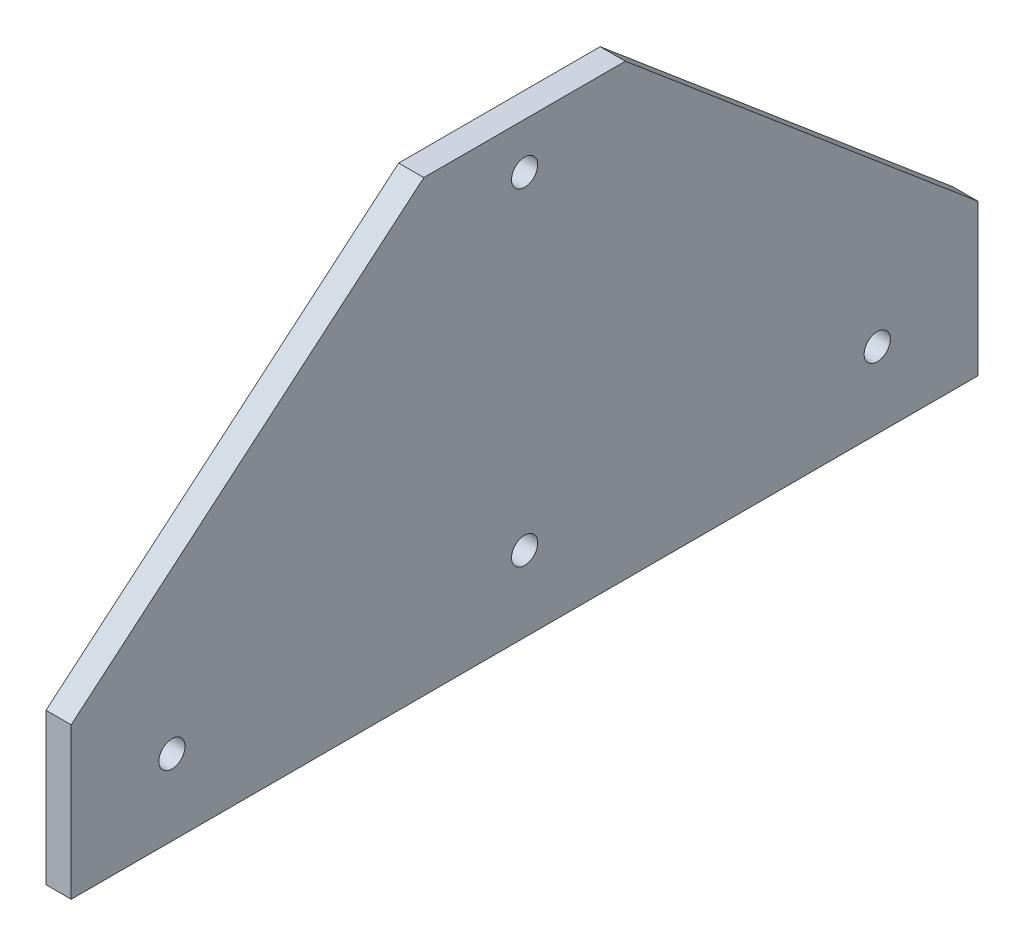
ISO-10303-21;
HEADER;
FILE_DESCRIPTION(('STEP AP214'),'2;1');
FILE_NAME('part.step','',(''),(''),'','','');
FILE_SCHEMA(('AUTOMOTIVE_DESIGN { 1 0 10303 214 1 1 1 1 }'));
ENDSEC;
DATA;
#1=APPLICATION_CONTEXT('core data for automotive mechanical design processes');
#2=APPLICATION_PROTOCOL_DEFINITION('international standard','automotive_design',2000,#1);
#3=PRODUCT_CONTEXT('',#1,'mechanical');
#4=PRODUCT('Part','Part','',(#3));
#5=PRODUCT_RELATED_PRODUCT_CATEGORY('part','',(#4));
#6=PRODUCT_DEFINITION_FORMATION('','',#4);
#7=PRODUCT_DEFINITION_CONTEXT('part definition',#1,'design');
#8=PRODUCT_DEFINITION('design','',#6,#7);
#9=PRODUCT_DEFINITION_SHAPE('','',#8);
#10=(LENGTH_UNIT() NAMED_UNIT(*) SI_UNIT(.MILLI.,.METRE.));
#11=(NAMED_UNIT(*) PLANE_ANGLE_UNIT() SI_UNIT($,.RADIAN.));
#12=(NAMED_UNIT(*) SI_UNIT($,.STERADIAN.) SOLID_ANGLE_UNIT());
#13=UNCERTAINTY_MEASURE_WITH_UNIT(LENGTH_MEASURE(1.E-05),#10,'distance_accuracy_value','');
#14=(GEOMETRIC_REPRESENTATION_CONTEXT(3) GLOBAL_UNCERTAINTY_ASSIGNED_CONTEXT((#13)) GLOBAL_UNIT_ASSIGNED_CONTEXT((#10,
#11,#12)) REPRESENTATION_CONTEXT('',''));
#15=CARTESIAN_POINT('',(0.,0.,0.));
#16=DIRECTION('',(0.,0.,1.));
#17=DIRECTION('',(1.,0.,0.));
#18=AXIS2_PLACEMENT_3D('',#15,#16,#17);
#19=CARTESIAN_POINT('',(6.35,34.8644879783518,77.6345072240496));
#20=DIRECTION('',(0.,0.,-1.));
#21=DIRECTION('',(-1.,0.,0.));
#22=AXIS2_PLACEMENT_3D('',#19,#20,#21);
#23=PLANE('',#22);
#24=DIRECTION('',(0.,-1.,0.));
#25=VECTOR('',#24,1.);
#26=CARTESIAN_POINT('',(0.,34.8644879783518,77.6345072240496));
#27=LINE('',#26,#25);
#28=CARTESIAN_POINT('',(0.,72.9644879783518,77.6345072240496));
#29=VERTEX_POINT('',#28);
#30=CARTESIAN_POINT('',(0.,34.8644879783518,77.6345072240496));
#31=VERTEX_POINT('',#30);
#32=EDGE_CURVE('E117',#29,#31,#27,.T.);
#33=ORIENTED_EDGE('',*,*,#32,.T.);
#34=DIRECTION('',(-1.,0.,0.));
#35=VECTOR('',#34,1.);
#36=CARTESIAN_POINT('',(6.35,34.8644879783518,77.6345072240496));
#37=LINE('',#36,#35);
#38=CARTESIAN_POINT('',(6.35,34.8644879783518,77.6345072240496));
#39=VERTEX_POINT('',#38);
#40=EDGE_CURVE('E11',#39,#31,#37,.T.);
#41=ORIENTED_EDGE('',*,*,#40,.F.);
#42=DIRECTION('',(0.,-1.,0.));
#43=VECTOR('',#42,1.);
#44=CARTESIAN_POINT('',(6.35,34.8644879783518,77.6345072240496));
#45=LINE('',#44,#43);
#46=CARTESIAN_POINT('',(6.35,72.9644879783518,77.6345072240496));
#47=VERTEX_POINT('',#46);
#48=EDGE_CURVE('E128',#47,#39,#45,.T.);
#49=ORIENTED_EDGE('',*,*,#48,.F.);
#50=DIRECTION('',(-1.,0.,0.));
#51=VECTOR('',#50,1.);
#52=CARTESIAN_POINT('',(6.35,72.9644879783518,77.6345072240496));
#53=LINE('',#52,#51);
#54=EDGE_CURVE('E113',#47,#29,#53,.T.);
#55=ORIENTED_EDGE('',*,*,#54,.T.);
#56=EDGE_LOOP('',(#33,#41,#49,#55));
#57=FACE_BOUND('',#56,.T.);
#58=ADVANCED_FACE('F33',(#57),#23,.F.);
#59=CARTESIAN_POINT('',(6.35,34.8644879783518,77.6345072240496));
#60=DIRECTION('',(0.,1.,0.));
#61=DIRECTION('',(0.,0.,1.));
#62=AXIS2_PLACEMENT_3D('',#59,#60,#61);
#63=PLANE('',#62);
#64=DIRECTION('',(0.,0.,-1.));
#65=VECTOR('',#64,1.);
#66=CARTESIAN_POINT('',(0.,34.8644879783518,77.6345072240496));
#67=LINE('',#66,#65);
#68=CARTESIAN_POINT('',(0.,34.8644879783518,-150.96549277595));
#69=VERTEX_POINT('',#68);
#70=EDGE_CURVE('E120',#31,#69,#67,.T.);
#71=ORIENTED_EDGE('',*,*,#70,.T.);
#72=DIRECTION('',(-1.,0.,0.));
#73=VECTOR('',#72,1.);
#74=CARTESIAN_POINT('',(6.35,34.8644879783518,-150.96549277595));
#75=LINE('',#74,#73);
#76=CARTESIAN_POINT('',(6.35,34.8644879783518,-150.96549277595));
#77=VERTEX_POINT('',#76);
#78=EDGE_CURVE('E41',#77,#69,#75,.T.);
#79=ORIENTED_EDGE('',*,*,#78,.F.);
#80=DIRECTION('',(0.,0.,-1.));
#81=VECTOR('',#80,1.);
#82=CARTESIAN_POINT('',(6.35,34.8644879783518,77.6345072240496));
#83=LINE('',#82,#81);
#84=EDGE_CURVE('E86',#39,#77,#83,.T.);
#85=ORIENTED_EDGE('',*,*,#84,.F.);
#86=ORIENTED_EDGE('',*,*,#40,.T.);
#87=EDGE_LOOP('',(#71,#79,#85,#86));
#88=FACE_BOUND('',#87,.T.);
#89=ADVANCED_FACE('F153',(#88),#63,.F.);
#90=CARTESIAN_POINT('',(6.35,34.8644879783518,-150.96549277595));
#91=DIRECTION('',(0.,0.,1.));
#92=DIRECTION('',(0.,-1.,0.));
#93=AXIS2_PLACEMENT_3D('',#90,#91,#92);
#94=PLANE('',#93);
#95=DIRECTION('',(0.,1.,0.));
#96=VECTOR('',#95,1.);
#97=CARTESIAN_POINT('',(0.,34.8644879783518,-150.96549277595));
#98=LINE('',#97,#96);
#99=CARTESIAN_POINT('',(0.,72.9644879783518,-150.96549277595));
#100=VERTEX_POINT('',#99);
#101=EDGE_CURVE('E123',#69,#100,#98,.T.);
#102=ORIENTED_EDGE('',*,*,#101,.T.);
#103=DIRECTION('',(-1.,0.,0.));
#104=VECTOR('',#103,1.);
#105=CARTESIAN_POINT('',(6.35,72.9644879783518,-150.96549277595));
#106=LINE('',#105,#104);
#107=CARTESIAN_POINT('',(6.35,72.9644879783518,-150.96549277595));
#108=VERTEX_POINT('',#107);
#109=EDGE_CURVE('E108',#108,#100,#106,.T.);
#110=ORIENTED_EDGE('',*,*,#109,.F.);
#111=DIRECTION('',(0.,1.,0.));
#112=VECTOR('',#111,1.);
#113=CARTESIAN_POINT('',(6.35,34.8644879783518,-150.96549277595));
#114=LINE('',#113,#112);
#115=EDGE_CURVE('E99',#77,#108,#114,.T.);
#116=ORIENTED_EDGE('',*,*,#115,.F.);
#117=ORIENTED_EDGE('',*,*,#78,.T.);
#118=EDGE_LOOP('',(#102,#110,#116,#117));
#119=FACE_BOUND('',#118,.T.);
#120=ADVANCED_FACE('F134',(#119),#94,.F.);
#121=CARTESIAN_POINT('',(6.35,147.98324545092,-62.0654927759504));
#122=DIRECTION('',(0.,-0.76425172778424,0.644918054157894));
#123=DIRECTION('',(0.,-0.644918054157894,-0.76425172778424));
#124=AXIS2_PLACEMENT_3D('',#121,#122,#123);
#125=PLANE('',#124);
#126=DIRECTION('',(0.,0.644918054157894,0.76425172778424));
#127=VECTOR('',#126,1.);
#128=CARTESIAN_POINT('',(0.,147.98324545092,-62.0654927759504));
#129=LINE('',#128,#127);
#130=CARTESIAN_POINT('',(0.,147.98324545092,-62.0654927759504));
#131=VERTEX_POINT('',#130);
#132=EDGE_CURVE('E107',#100,#131,#129,.T.);
#133=ORIENTED_EDGE('',*,*,#132,.T.);
#134=DIRECTION('',(-1.,0.,0.));
#135=VECTOR('',#134,1.);
#136=CARTESIAN_POINT('',(6.35,147.98324545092,-62.0654927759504));
#137=LINE('',#136,#135);
#138=CARTESIAN_POINT('',(6.35,147.98324545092,-62.0654927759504));
#139=VERTEX_POINT('',#138);
#140=EDGE_CURVE('E104',#139,#131,#137,.T.);
#141=ORIENTED_EDGE('',*,*,#140,.F.);
#142=DIRECTION('',(0.,0.644918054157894,0.76425172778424));
#143=VECTOR('',#142,1.);
#144=CARTESIAN_POINT('',(6.35,147.98324545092,-62.0654927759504));
#145=LINE('',#144,#143);
#146=EDGE_CURVE('E93',#108,#139,#145,.T.);
#147=ORIENTED_EDGE('',*,*,#146,.F.);
#148=ORIENTED_EDGE('',*,*,#109,.T.);
#149=EDGE_LOOP('',(#133,#141,#147,#148));
#150=FACE_BOUND('',#149,.T.);
#151=ADVANCED_FACE('F105',(#150),#125,.F.);
#152=CARTESIAN_POINT('',(6.35,147.98324545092,-11.2654927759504));
#153=DIRECTION('',(0.,-1.,0.));
#154=DIRECTION('',(0.,0.,-1.));
#155=AXIS2_PLACEMENT_3D('',#152,#153,#154);
#156=PLANE('',#155);
#157=DIRECTION('',(0.,0.,1.));
#158=VECTOR('',#157,1.);
#159=CARTESIAN_POINT('',(0.,147.98324545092,-11.2654927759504));
#160=LINE('',#159,#158);
#161=CARTESIAN_POINT('',(0.,147.98324545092,-11.2654927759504));
#162=VERTEX_POINT('',#161);
#163=EDGE_CURVE('E72',#131,#162,#160,.T.);
#164=ORIENTED_EDGE('',*,*,#163,.T.);
#165=DIRECTION('',(-1.,0.,0.));
#166=VECTOR('',#165,1.);
#167=CARTESIAN_POINT('',(6.35,147.98324545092,-11.2654927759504));
#168=LINE('',#167,#166);
#169=CARTESIAN_POINT('',(6.35,147.98324545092,-11.2654927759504));
#170=VERTEX_POINT('',#169);
#171=EDGE_CURVE('E109',#170,#162,#168,.T.);
#172=ORIENTED_EDGE('',*,*,#171,.F.);
#173=DIRECTION('',(0.,0.,1.));
#174=VECTOR('',#173,1.);
#175=CARTESIAN_POINT('',(6.35,147.98324545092,-11.2654927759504));
#176=LINE('',#175,#174);
#177=EDGE_CURVE('E97',#139,#170,#176,.T.);
#178=ORIENTED_EDGE('',*,*,#177,.F.);
#179=ORIENTED_EDGE('',*,*,#140,.T.);
#180=EDGE_LOOP('',(#164,#172,#178,#179));
#181=FACE_BOUND('',#180,.T.);
#182=ADVANCED_FACE('F111',(#181),#156,.F.);
#183=CARTESIAN_POINT('',(6.35,72.9644879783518,77.6345072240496));
#184=DIRECTION('',(0.,-0.76425172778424,-0.644918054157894));
#185=DIRECTION('',(0.,0.644918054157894,-0.76425172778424));
#186=AXIS2_PLACEMENT_3D('',#183,#184,#185);
#187=PLANE('',#186);
#188=DIRECTION('',(0.,-0.644918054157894,0.76425172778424));
#189=VECTOR('',#188,1.);
#190=CARTESIAN_POINT('',(0.,72.9644879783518,77.6345072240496));
#191=LINE('',#190,#189);
#192=EDGE_CURVE('E78',#162,#29,#191,.T.);
#193=ORIENTED_EDGE('',*,*,#192,.T.);
#194=ORIENTED_EDGE('',*,*,#54,.F.);
#195=DIRECTION('',(0.,-0.644918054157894,0.76425172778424));
#196=VECTOR('',#195,1.);
#197=CARTESIAN_POINT('',(6.35,72.9644879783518,77.6345072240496));
#198=LINE('',#197,#196);
#199=EDGE_CURVE('E49',#170,#47,#198,.T.);
#200=ORIENTED_EDGE('',*,*,#199,.F.);
#201=ORIENTED_EDGE('',*,*,#171,.T.);
#202=EDGE_LOOP('',(#193,#194,#200,#201));
#203=FACE_BOUND('',#202,.T.);
#204=ADVANCED_FACE('F141',(#203),#187,.F.);
#205=CARTESIAN_POINT('',(6.35,0.,0.));
#206=DIRECTION('',(-1.,0.,0.));
#207=DIRECTION('',(0.,0.,1.));
#208=AXIS2_PLACEMENT_3D('',#205,#206,#207);
#209=PLANE('',#208);
#210=CARTESIAN_POINT('',(6.35,53.9144879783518,-125.56549277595));
#211=DIRECTION('',(-1.,0.,0.));
#212=DIRECTION('',(0.,0.,1.));
#213=AXIS2_PLACEMENT_3D('',#210,#211,#212);
#214=CIRCLE('',#213,3.302);
#215=CARTESIAN_POINT('',(6.35,53.9144879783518,-122.26349277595));
#216=VERTEX_POINT('',#215);
#217=EDGE_CURVE('E236',#216,#216,#214,.T.);
#218=ORIENTED_EDGE('',*,*,#217,.T.);
#219=EDGE_LOOP('',(#218));
#220=FACE_BOUND('',#219,.T.);
#221=CARTESIAN_POINT('',(6.35,136.464487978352,-36.6654927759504));
#222=DIRECTION('',(-1.,0.,0.));
#223=DIRECTION('',(0.,0.,1.));
#224=AXIS2_PLACEMENT_3D('',#221,#222,#223);
#225=CIRCLE('',#224,3.302);
#226=CARTESIAN_POINT('',(6.35,136.464487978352,-33.3634927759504));
#227=VERTEX_POINT('',#226);
#228=EDGE_CURVE('E244',#227,#227,#225,.T.);
#229=ORIENTED_EDGE('',*,*,#228,.T.);
#230=EDGE_LOOP('',(#229));
#231=FACE_BOUND('',#230,.T.);
#232=CARTESIAN_POINT('',(6.35,53.9144879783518,-36.6654927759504));
#233=DIRECTION('',(-1.,0.,0.));
#234=DIRECTION('',(0.,0.,1.));
#235=AXIS2_PLACEMENT_3D('',#232,#233,#234);
#236=CIRCLE('',#235,3.302);
#237=CARTESIAN_POINT('',(6.35,53.9144879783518,-33.3634927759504));
#238=VERTEX_POINT('',#237);
#239=EDGE_CURVE('E250',#238,#238,#236,.T.);
#240=ORIENTED_EDGE('',*,*,#239,.T.);
#241=EDGE_LOOP('',(#240));
#242=FACE_BOUND('',#241,.T.);
#243=CARTESIAN_POINT('',(6.35,53.9144879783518,52.2345072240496));
#244=DIRECTION('',(-1.,0.,0.));
#245=DIRECTION('',(0.,0.,1.));
#246=AXIS2_PLACEMENT_3D('',#243,#244,#245);
#247=CIRCLE('',#246,3.302);
#248=CARTESIAN_POINT('',(6.35,53.9144879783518,55.5365072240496));
#249=VERTEX_POINT('',#248);
#250=EDGE_CURVE('E121',#249,#249,#247,.T.);
#251=ORIENTED_EDGE('',*,*,#250,.T.);
#252=EDGE_LOOP('',(#251));
#253=FACE_BOUND('',#252,.T.);
#254=ORIENTED_EDGE('',*,*,#48,.T.);
#255=ORIENTED_EDGE('',*,*,#84,.T.);
#256=ORIENTED_EDGE('',*,*,#115,.T.);
#257=ORIENTED_EDGE('',*,*,#146,.T.);
#258=ORIENTED_EDGE('',*,*,#177,.T.);
#259=ORIENTED_EDGE('',*,*,#199,.T.);
#260=EDGE_LOOP('',(#254,#255,#256,#257,#258,#259));
#261=FACE_BOUND('',#260,.T.);
#262=ADVANCED_FACE('F95',(#220,#231,#242,#253,#261),#209,.F.);
#263=CARTESIAN_POINT('',(0.,0.,0.));
#264=DIRECTION('',(-1.,0.,0.));
#265=DIRECTION('',(0.,0.,1.));
#266=AXIS2_PLACEMENT_3D('',#263,#264,#265);
#267=PLANE('',#266);
#268=CARTESIAN_POINT('',(0.,53.9144879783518,-125.56549277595));
#269=DIRECTION('',(-1.,0.,0.));
#270=DIRECTION('',(0.,0.,1.));
#271=AXIS2_PLACEMENT_3D('',#268,#269,#270);
#272=CIRCLE('',#271,3.302);
#273=CARTESIAN_POINT('',(0.,53.9144879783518,-122.26349277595));
#274=VERTEX_POINT('',#273);
#275=EDGE_CURVE('E239',#274,#274,#272,.T.);
#276=ORIENTED_EDGE('',*,*,#275,.F.);
#277=EDGE_LOOP('',(#276));
#278=FACE_BOUND('',#277,.T.);
#279=CARTESIAN_POINT('',(0.,136.464487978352,-36.6654927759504));
#280=DIRECTION('',(-1.,0.,0.));
#281=DIRECTION('',(0.,0.,1.));
#282=AXIS2_PLACEMENT_3D('',#279,#280,#281);
#283=CIRCLE('',#282,3.302);
#284=CARTESIAN_POINT('',(0.,136.464487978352,-33.3634927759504));
#285=VERTEX_POINT('',#284);
#286=EDGE_CURVE('E241',#285,#285,#283,.T.);
#287=ORIENTED_EDGE('',*,*,#286,.F.);
#288=EDGE_LOOP('',(#287));
#289=FACE_BOUND('',#288,.T.);
#290=CARTESIAN_POINT('',(0.,53.9144879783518,-36.6654927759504));
#291=DIRECTION('',(-1.,0.,0.));
#292=DIRECTION('',(0.,0.,1.));
#293=AXIS2_PLACEMENT_3D('',#290,#291,#292);
#294=CIRCLE('',#293,3.302);
#295=CARTESIAN_POINT('',(0.,53.9144879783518,-33.3634927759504));
#296=VERTEX_POINT('',#295);
#297=EDGE_CURVE('E247',#296,#296,#294,.T.);
#298=ORIENTED_EDGE('',*,*,#297,.F.);
#299=EDGE_LOOP('',(#298));
#300=FACE_BOUND('',#299,.T.);
#301=CARTESIAN_POINT('',(0.,53.9144879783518,52.2345072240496));
#302=DIRECTION('',(-1.,0.,0.));
#303=DIRECTION('',(0.,0.,1.));
#304=AXIS2_PLACEMENT_3D('',#301,#302,#303);
#305=CIRCLE('',#304,3.302);
#306=CARTESIAN_POINT('',(0.,53.9144879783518,55.5365072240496));
#307=VERTEX_POINT('',#306);
#308=EDGE_CURVE('E253',#307,#307,#305,.T.);
#309=ORIENTED_EDGE('',*,*,#308,.F.);
#310=EDGE_LOOP('',(#309));
#311=FACE_BOUND('',#310,.T.);
#312=ORIENTED_EDGE('',*,*,#32,.F.);
#313=ORIENTED_EDGE('',*,*,#192,.F.);
#314=ORIENTED_EDGE('',*,*,#163,.F.);
#315=ORIENTED_EDGE('',*,*,#132,.F.);
#316=ORIENTED_EDGE('',*,*,#101,.F.);
#317=ORIENTED_EDGE('',*,*,#70,.F.);
#318=EDGE_LOOP('',(#312,#313,#314,#315,#316,#317));
#319=FACE_BOUND('',#318,.T.);
#320=ADVANCED_FACE('F137',(#278,#289,#300,#311,#319),#267,.T.);
#321=CARTESIAN_POINT('',(6.35,53.9144879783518,52.2345072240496));
#322=DIRECTION('',(-1.,0.,0.));
#323=DIRECTION('',(0.,0.,1.));
#324=AXIS2_PLACEMENT_3D('',#321,#322,#323);
#325=CYLINDRICAL_SURFACE('',#324,3.302);
#326=ORIENTED_EDGE('',*,*,#250,.F.);
#327=EDGE_LOOP('',(#326));
#328=FACE_BOUND('',#327,.T.);
#329=ORIENTED_EDGE('',*,*,#308,.T.);
#330=EDGE_LOOP('',(#329));
#331=FACE_BOUND('',#330,.T.);
#332=ADVANCED_FACE('F190',(#328,#331),#325,.F.);
#333=CARTESIAN_POINT('',(6.35,53.9144879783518,-36.6654927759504));
#334=DIRECTION('',(-1.,0.,0.));
#335=DIRECTION('',(0.,0.,1.));
#336=AXIS2_PLACEMENT_3D('',#333,#334,#335);
#337=CYLINDRICAL_SURFACE('',#336,3.302);
#338=ORIENTED_EDGE('',*,*,#239,.F.);
#339=EDGE_LOOP('',(#338));
#340=FACE_BOUND('',#339,.T.);
#341=ORIENTED_EDGE('',*,*,#297,.T.);
#342=EDGE_LOOP('',(#341));
#343=FACE_BOUND('',#342,.T.);
#344=ADVANCED_FACE('F199',(#340,#343),#337,.F.);
#345=CARTESIAN_POINT('',(6.35,136.464487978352,-36.6654927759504));
#346=DIRECTION('',(-1.,0.,0.));
#347=DIRECTION('',(0.,0.,1.));
#348=AXIS2_PLACEMENT_3D('',#345,#346,#347);
#349=CYLINDRICAL_SURFACE('',#348,3.302);
#350=ORIENTED_EDGE('',*,*,#228,.F.);
#351=EDGE_LOOP('',(#350));
#352=FACE_BOUND('',#351,.T.);
#353=ORIENTED_EDGE('',*,*,#286,.T.);
#354=EDGE_LOOP('',(#353));
#355=FACE_BOUND('',#354,.T.);
#356=ADVANCED_FACE('F209',(#352,#355),#349,.F.);
#357=CARTESIAN_POINT('',(6.35,53.9144879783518,-125.56549277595));
#358=DIRECTION('',(-1.,0.,0.));
#359=DIRECTION('',(0.,0.,1.));
#360=AXIS2_PLACEMENT_3D('',#357,#358,#359);
#361=CYLINDRICAL_SURFACE('',#360,3.302);
#362=ORIENTED_EDGE('',*,*,#217,.F.);
#363=EDGE_LOOP('',(#362));
#364=FACE_BOUND('',#363,.T.);
#365=ORIENTED_EDGE('',*,*,#275,.T.);
#366=EDGE_LOOP('',(#365));
#367=FACE_BOUND('',#366,.T.);
#368=ADVANCED_FACE('F219',(#364,#367),#361,.F.);
#369=CLOSED_SHELL('',(#58,#89,#120,#151,#182,#204,#262,#320,#332,#344,#356,#368));
#370=MANIFOLD_SOLID_BREP('B2',#369);
#371=ADVANCED_BREP_SHAPE_REPRESENTATION('',(#18,#370),#14);
#372=SHAPE_DEFINITION_REPRESENTATION(#9,#371);
ENDSEC;
END-ISO-10303-21;
